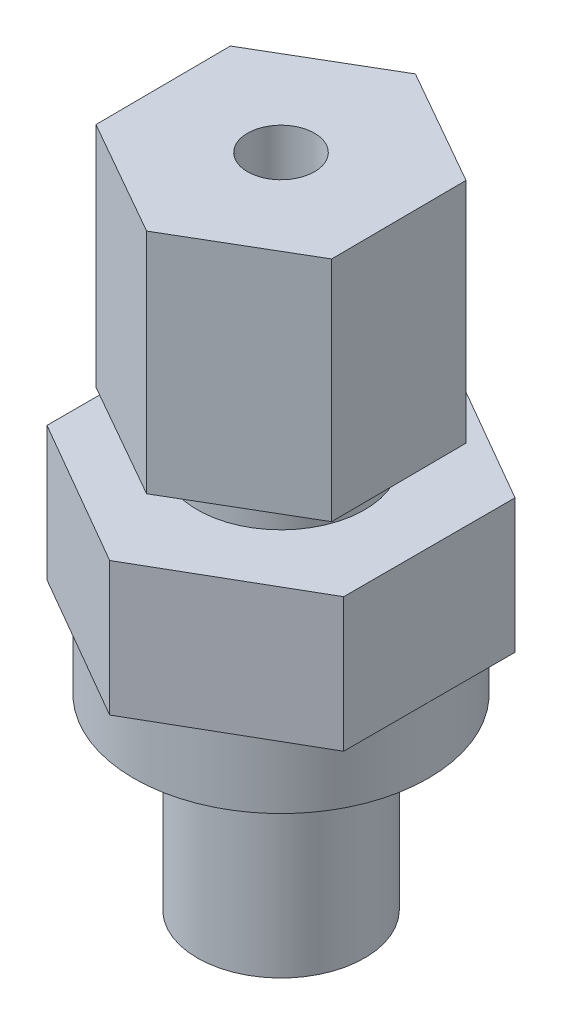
ISO-10303-21;
HEADER;
FILE_DESCRIPTION(('STEP AP214'),'2;1');
FILE_NAME('part.step','',(''),(''),'','','');
FILE_SCHEMA(('AUTOMOTIVE_DESIGN { 1 0 10303 214 1 1 1 1 }'));
ENDSEC;
DATA;
#1=APPLICATION_CONTEXT('core data for automotive mechanical design processes');
#2=APPLICATION_PROTOCOL_DEFINITION('international standard','automotive_design',2000,#1);
#3=PRODUCT_CONTEXT('',#1,'mechanical');
#4=PRODUCT('Part','Part','',(#3));
#5=PRODUCT_RELATED_PRODUCT_CATEGORY('part','',(#4));
#6=PRODUCT_DEFINITION_FORMATION('','',#4);
#7=PRODUCT_DEFINITION_CONTEXT('part definition',#1,'design');
#8=PRODUCT_DEFINITION('design','',#6,#7);
#9=PRODUCT_DEFINITION_SHAPE('','',#8);
#10=(LENGTH_UNIT() NAMED_UNIT(*) SI_UNIT(.MILLI.,.METRE.));
#11=(NAMED_UNIT(*) PLANE_ANGLE_UNIT() SI_UNIT($,.RADIAN.));
#12=(NAMED_UNIT(*) SI_UNIT($,.STERADIAN.) SOLID_ANGLE_UNIT());
#13=UNCERTAINTY_MEASURE_WITH_UNIT(LENGTH_MEASURE(1.E-05),#10,'distance_accuracy_value','');
#14=(GEOMETRIC_REPRESENTATION_CONTEXT(3) GLOBAL_UNCERTAINTY_ASSIGNED_CONTEXT((#13)) GLOBAL_UNIT_ASSIGNED_CONTEXT((#10,
#11,#12)) REPRESENTATION_CONTEXT('',''));
#15=CARTESIAN_POINT('',(0.,0.,0.));
#16=DIRECTION('',(0.,0.,1.));
#17=DIRECTION('',(1.,0.,0.));
#18=AXIS2_PLACEMENT_3D('',#15,#16,#17);
#19=CARTESIAN_POINT('',(-7.03905448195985,18.415,12.192));
#20=DIRECTION('',(0.,-1.,0.));
#21=DIRECTION('',(0.,0.,-1.));
#22=AXIS2_PLACEMENT_3D('',#19,#20,#21);
#23=PLANE('',#22);
#24=DIRECTION('',(0.,0.,1.));
#25=VECTOR('',#24,1.);
#26=CARTESIAN_POINT('',(-7.0390544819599,18.415,-4.06400000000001));
#27=LINE('',#26,#25);
#28=CARTESIAN_POINT('',(-7.0390544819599,18.415,-4.06400000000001));
#29=VERTEX_POINT('',#28);
#30=CARTESIAN_POINT('',(-7.03905448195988,18.415,4.06400000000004));
#31=VERTEX_POINT('',#30);
#32=EDGE_CURVE('E132',#29,#31,#27,.T.);
#33=ORIENTED_EDGE('',*,*,#32,.T.);
#34=DIRECTION('',(0.866025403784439,0.,0.499999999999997));
#35=VECTOR('',#34,1.);
#36=CARTESIAN_POINT('',(-7.03905448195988,18.415,4.06400000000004));
#37=LINE('',#36,#35);
#38=CARTESIAN_POINT('',(0.,18.415,8.128));
#39=VERTEX_POINT('',#38);
#40=EDGE_CURVE('E88',#31,#39,#37,.T.);
#41=ORIENTED_EDGE('',*,*,#40,.T.);
#42=DIRECTION('',(0.86602540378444,0.,-0.499999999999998));
#43=VECTOR('',#42,1.);
#44=CARTESIAN_POINT('',(7.03905448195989,18.415,4.06400000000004));
#45=LINE('',#44,#43);
#46=CARTESIAN_POINT('',(7.03905448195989,18.415,4.06400000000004));
#47=VERTEX_POINT('',#46);
#48=EDGE_CURVE('E103',#39,#47,#45,.T.);
#49=ORIENTED_EDGE('',*,*,#48,.T.);
#50=DIRECTION('',(0.,0.,-1.));
#51=VECTOR('',#50,1.);
#52=CARTESIAN_POINT('',(7.03905448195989,18.415,-4.06399999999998));
#53=LINE('',#52,#51);
#54=CARTESIAN_POINT('',(7.03905448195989,18.415,-4.06399999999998));
#55=VERTEX_POINT('',#54);
#56=EDGE_CURVE('E97',#47,#55,#53,.T.);
#57=ORIENTED_EDGE('',*,*,#56,.T.);
#58=DIRECTION('',(-0.866025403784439,0.,-0.499999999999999));
#59=VECTOR('',#58,1.);
#60=CARTESIAN_POINT('',(7.03905448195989,18.415,-4.06399999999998));
#61=LINE('',#60,#59);
#62=CARTESIAN_POINT('',(0.,18.415,-8.12799999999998));
#63=VERTEX_POINT('',#62);
#64=EDGE_CURVE('E101',#55,#63,#61,.T.);
#65=ORIENTED_EDGE('',*,*,#64,.T.);
#66=DIRECTION('',(-0.866025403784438,0.,0.499999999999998));
#67=VECTOR('',#66,1.);
#68=CARTESIAN_POINT('',(-7.0390544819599,18.415,-4.06400000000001));
#69=LINE('',#68,#67);
#70=EDGE_CURVE('E49',#63,#29,#69,.T.);
#71=ORIENTED_EDGE('',*,*,#70,.T.);
#72=EDGE_LOOP('',(#33,#41,#49,#57,#65,#71));
#73=FACE_BOUND('',#72,.T.);
#74=CARTESIAN_POINT('',(0.,18.415,0.));
#75=DIRECTION('',(0.,-1.,0.));
#76=DIRECTION('',(0.,0.,-1.));
#77=AXIS2_PLACEMENT_3D('',#74,#75,#76);
#78=CIRCLE('',#77,3.96875);
#79=CARTESIAN_POINT('',(0.,18.415,-3.96875));
#80=VERTEX_POINT('',#79);
#81=EDGE_CURVE('E11',#80,#80,#78,.F.);
#82=ORIENTED_EDGE('',*,*,#81,.F.);
#83=EDGE_LOOP('',(#82));
#84=FACE_BOUND('',#83,.T.);
#85=ADVANCED_FACE('F30',(#73,#84),#23,.F.);
#86=CARTESIAN_POINT('',(0.,8.88999999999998,0.));
#87=DIRECTION('',(0.,-1.,0.));
#88=DIRECTION('',(0.,0.,-1.));
#89=AXIS2_PLACEMENT_3D('',#86,#87,#88);
#90=CYLINDRICAL_SURFACE('',#89,3.96875);
#91=CARTESIAN_POINT('',(0.,8.88999999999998,0.));
#92=DIRECTION('',(0.,1.,0.));
#93=DIRECTION('',(0.,0.,1.));
#94=AXIS2_PLACEMENT_3D('',#91,#92,#93);
#95=CIRCLE('',#94,3.96875);
#96=CARTESIAN_POINT('',(0.,8.88999999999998,3.96875));
#97=VERTEX_POINT('',#96);
#98=EDGE_CURVE('E40',#97,#97,#95,.T.);
#99=ORIENTED_EDGE('',*,*,#98,.F.);
#100=EDGE_LOOP('',(#99));
#101=FACE_BOUND('',#100,.T.);
#102=CARTESIAN_POINT('',(0.,0.,0.));
#103=DIRECTION('',(0.,1.,0.));
#104=DIRECTION('',(0.,0.,1.));
#105=AXIS2_PLACEMENT_3D('',#102,#103,#104);
#106=CIRCLE('',#105,3.96875);
#107=CARTESIAN_POINT('',(0.,0.,3.96875));
#108=VERTEX_POINT('',#107);
#109=EDGE_CURVE('E145',#108,#108,#106,.T.);
#110=ORIENTED_EDGE('',*,*,#109,.T.);
#111=EDGE_LOOP('',(#110));
#112=FACE_BOUND('',#111,.T.);
#113=ADVANCED_FACE('F32',(#101,#112),#90,.T.);
#114=CARTESIAN_POINT('',(0.,0.,0.));
#115=DIRECTION('',(0.,1.,0.));
#116=DIRECTION('',(0.,0.,1.));
#117=AXIS2_PLACEMENT_3D('',#114,#115,#116);
#118=PLANE('',#117);
#119=CARTESIAN_POINT('',(0.,0.,0.));
#120=DIRECTION('',(0.,-1.,0.));
#121=DIRECTION('',(0.,0.,-1.));
#122=AXIS2_PLACEMENT_3D('',#119,#120,#121);
#123=CIRCLE('',#122,1.1684);
#124=CARTESIAN_POINT('',(0.,0.,-1.1684));
#125=VERTEX_POINT('',#124);
#126=EDGE_CURVE('E239',#125,#125,#123,.T.);
#127=ORIENTED_EDGE('',*,*,#126,.F.);
#128=EDGE_LOOP('',(#127));
#129=FACE_BOUND('',#128,.T.);
#130=ORIENTED_EDGE('',*,*,#109,.F.);
#131=EDGE_LOOP('',(#130));
#132=FACE_BOUND('',#131,.T.);
#133=ADVANCED_FACE('F212',(#129,#132),#118,.F.);
#134=CARTESIAN_POINT('',(0.,8.88999999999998,0.));
#135=DIRECTION('',(0.,1.,0.));
#136=DIRECTION('',(0.,0.,1.));
#137=AXIS2_PLACEMENT_3D('',#134,#135,#136);
#138=PLANE('',#137);
#139=CARTESIAN_POINT('',(0.,8.88999999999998,0.));
#140=DIRECTION('',(0.,1.,0.));
#141=DIRECTION('',(0.,0.,1.));
#142=AXIS2_PLACEMENT_3D('',#139,#140,#141);
#143=CIRCLE('',#142,6.985);
#144=CARTESIAN_POINT('',(0.,8.88999999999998,6.985));
#145=VERTEX_POINT('',#144);
#146=EDGE_CURVE('E141',#145,#145,#143,.T.);
#147=ORIENTED_EDGE('',*,*,#146,.F.);
#148=EDGE_LOOP('',(#147));
#149=FACE_BOUND('',#148,.T.);
#150=ORIENTED_EDGE('',*,*,#98,.T.);
#151=EDGE_LOOP('',(#150));
#152=FACE_BOUND('',#151,.T.);
#153=ADVANCED_FACE('F222',(#149,#152),#138,.F.);
#154=CARTESIAN_POINT('',(0.,12.065,0.));
#155=DIRECTION('',(0.,-1.,0.));
#156=DIRECTION('',(0.,0.,-1.));
#157=AXIS2_PLACEMENT_3D('',#154,#155,#156);
#158=CYLINDRICAL_SURFACE('',#157,6.985);
#159=CARTESIAN_POINT('',(0.,12.065,0.));
#160=DIRECTION('',(0.,1.,0.));
#161=DIRECTION('',(0.,0.,1.));
#162=AXIS2_PLACEMENT_3D('',#159,#160,#161);
#163=CIRCLE('',#162,6.985);
#164=CARTESIAN_POINT('',(0.,12.065,6.985));
#165=VERTEX_POINT('',#164);
#166=EDGE_CURVE('E142',#165,#165,#163,.T.);
#167=ORIENTED_EDGE('',*,*,#166,.F.);
#168=EDGE_LOOP('',(#167));
#169=FACE_BOUND('',#168,.T.);
#170=ORIENTED_EDGE('',*,*,#146,.T.);
#171=EDGE_LOOP('',(#170));
#172=FACE_BOUND('',#171,.T.);
#173=ADVANCED_FACE('F216',(#169,#172),#158,.T.);
#174=CARTESIAN_POINT('',(-7.03905448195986,12.065,12.192));
#175=DIRECTION('',(0.,-1.,0.));
#176=DIRECTION('',(0.,0.,-1.));
#177=AXIS2_PLACEMENT_3D('',#174,#175,#176);
#178=PLANE('',#177);
#179=DIRECTION('',(0.,0.,1.));
#180=VECTOR('',#179,1.);
#181=CARTESIAN_POINT('',(-7.0390544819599,12.065,-4.06400000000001));
#182=LINE('',#181,#180);
#183=CARTESIAN_POINT('',(-7.0390544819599,12.065,-4.06400000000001));
#184=VERTEX_POINT('',#183);
#185=CARTESIAN_POINT('',(-7.03905448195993,12.065,4.06400000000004));
#186=VERTEX_POINT('',#185);
#187=EDGE_CURVE('E121',#184,#186,#182,.T.);
#188=ORIENTED_EDGE('',*,*,#187,.F.);
#189=DIRECTION('',(-0.866025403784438,0.,0.499999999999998));
#190=VECTOR('',#189,1.);
#191=CARTESIAN_POINT('',(-7.0390544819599,12.065,-4.06400000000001));
#192=LINE('',#191,#190);
#193=CARTESIAN_POINT('',(0.,12.065,-8.12799999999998));
#194=VERTEX_POINT('',#193);
#195=EDGE_CURVE('E79',#194,#184,#192,.T.);
#196=ORIENTED_EDGE('',*,*,#195,.F.);
#197=DIRECTION('',(-0.866025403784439,0.,-0.499999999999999));
#198=VECTOR('',#197,1.);
#199=CARTESIAN_POINT('',(7.03905448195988,12.065,-4.06399999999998));
#200=LINE('',#199,#198);
#201=CARTESIAN_POINT('',(7.03905448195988,12.065,-4.06399999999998));
#202=VERTEX_POINT('',#201);
#203=EDGE_CURVE('E73',#202,#194,#200,.T.);
#204=ORIENTED_EDGE('',*,*,#203,.F.);
#205=DIRECTION('',(0.,0.,-1.));
#206=VECTOR('',#205,1.);
#207=CARTESIAN_POINT('',(7.03905448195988,12.065,-4.06399999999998));
#208=LINE('',#207,#206);
#209=CARTESIAN_POINT('',(7.03905448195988,12.065,4.06400000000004));
#210=VERTEX_POINT('',#209);
#211=EDGE_CURVE('E111',#210,#202,#208,.T.);
#212=ORIENTED_EDGE('',*,*,#211,.F.);
#213=DIRECTION('',(0.86602540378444,0.,-0.499999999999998));
#214=VECTOR('',#213,1.);
#215=CARTESIAN_POINT('',(7.03905448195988,12.065,4.06400000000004));
#216=LINE('',#215,#214);
#217=CARTESIAN_POINT('',(0.,12.065,8.128));
#218=VERTEX_POINT('',#217);
#219=EDGE_CURVE('E127',#218,#210,#216,.T.);
#220=ORIENTED_EDGE('',*,*,#219,.F.);
#221=DIRECTION('',(0.866025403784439,0.,0.499999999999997));
#222=VECTOR('',#221,1.);
#223=CARTESIAN_POINT('',(-7.03905448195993,12.065,4.06400000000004));
#224=LINE('',#223,#222);
#225=EDGE_CURVE('E124',#186,#218,#224,.T.);
#226=ORIENTED_EDGE('',*,*,#225,.F.);
#227=EDGE_LOOP('',(#188,#196,#204,#212,#220,#226));
#228=FACE_BOUND('',#227,.T.);
#229=ORIENTED_EDGE('',*,*,#166,.T.);
#230=EDGE_LOOP('',(#229));
#231=FACE_BOUND('',#230,.T.);
#232=ADVANCED_FACE('F191',(#228,#231),#178,.T.);
#233=CARTESIAN_POINT('',(-7.0390544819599,18.415,-4.06400000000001));
#234=DIRECTION('',(1.,0.,0.));
#235=DIRECTION('',(0.,0.,-1.));
#236=AXIS2_PLACEMENT_3D('',#233,#234,#235);
#237=PLANE('',#236);
#238=ORIENTED_EDGE('',*,*,#187,.T.);
#239=DIRECTION('',(0.,-1.,0.));
#240=VECTOR('',#239,1.);
#241=CARTESIAN_POINT('',(-7.03905448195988,18.415,4.06400000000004));
#242=LINE('',#241,#240);
#243=EDGE_CURVE('E139',#31,#186,#242,.T.);
#244=ORIENTED_EDGE('',*,*,#243,.F.);
#245=ORIENTED_EDGE('',*,*,#32,.F.);
#246=DIRECTION('',(0.,-1.,0.));
#247=VECTOR('',#246,1.);
#248=CARTESIAN_POINT('',(-7.0390544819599,18.415,-4.06400000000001));
#249=LINE('',#248,#247);
#250=EDGE_CURVE('E117',#29,#184,#249,.T.);
#251=ORIENTED_EDGE('',*,*,#250,.T.);
#252=EDGE_LOOP('',(#238,#244,#245,#251));
#253=FACE_BOUND('',#252,.T.);
#254=ADVANCED_FACE('F194',(#253),#237,.F.);
#255=CARTESIAN_POINT('',(-7.03905448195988,18.415,4.06400000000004));
#256=DIRECTION('',(0.499999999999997,0.,-0.866025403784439));
#257=DIRECTION('',(-0.866025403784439,0.,-0.499999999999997));
#258=AXIS2_PLACEMENT_3D('',#255,#256,#257);
#259=PLANE('',#258);
#260=ORIENTED_EDGE('',*,*,#225,.T.);
#261=DIRECTION('',(0.,-1.,0.));
#262=VECTOR('',#261,1.);
#263=CARTESIAN_POINT('',(0.,18.415,8.128));
#264=LINE('',#263,#262);
#265=EDGE_CURVE('E136',#39,#218,#264,.T.);
#266=ORIENTED_EDGE('',*,*,#265,.F.);
#267=ORIENTED_EDGE('',*,*,#40,.F.);
#268=ORIENTED_EDGE('',*,*,#243,.T.);
#269=EDGE_LOOP('',(#260,#266,#267,#268));
#270=FACE_BOUND('',#269,.T.);
#271=ADVANCED_FACE('F185',(#270),#259,.F.);
#272=CARTESIAN_POINT('',(7.03905448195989,18.415,4.06400000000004));
#273=DIRECTION('',(-0.499999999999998,0.,-0.866025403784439));
#274=DIRECTION('',(-0.866025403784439,0.,0.499999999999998));
#275=AXIS2_PLACEMENT_3D('',#272,#273,#274);
#276=PLANE('',#275);
#277=ORIENTED_EDGE('',*,*,#219,.T.);
#278=DIRECTION('',(0.,-1.,0.));
#279=VECTOR('',#278,1.);
#280=CARTESIAN_POINT('',(7.03905448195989,18.415,4.06400000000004));
#281=LINE('',#280,#279);
#282=EDGE_CURVE('E112',#47,#210,#281,.T.);
#283=ORIENTED_EDGE('',*,*,#282,.F.);
#284=ORIENTED_EDGE('',*,*,#48,.F.);
#285=ORIENTED_EDGE('',*,*,#265,.T.);
#286=EDGE_LOOP('',(#277,#283,#284,#285));
#287=FACE_BOUND('',#286,.T.);
#288=ADVANCED_FACE('F188',(#287),#276,.F.);
#289=CARTESIAN_POINT('',(7.03905448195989,18.415,-4.06399999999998));
#290=DIRECTION('',(-1.,0.,0.));
#291=DIRECTION('',(0.,0.,1.));
#292=AXIS2_PLACEMENT_3D('',#289,#290,#291);
#293=PLANE('',#292);
#294=ORIENTED_EDGE('',*,*,#211,.T.);
#295=DIRECTION('',(0.,-1.,0.));
#296=VECTOR('',#295,1.);
#297=CARTESIAN_POINT('',(7.03905448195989,18.415,-4.06399999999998));
#298=LINE('',#297,#296);
#299=EDGE_CURVE('E108',#55,#202,#298,.T.);
#300=ORIENTED_EDGE('',*,*,#299,.F.);
#301=ORIENTED_EDGE('',*,*,#56,.F.);
#302=ORIENTED_EDGE('',*,*,#282,.T.);
#303=EDGE_LOOP('',(#294,#300,#301,#302));
#304=FACE_BOUND('',#303,.T.);
#305=ADVANCED_FACE('F109',(#304),#293,.F.);
#306=CARTESIAN_POINT('',(7.03905448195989,18.415,-4.06399999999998));
#307=DIRECTION('',(-0.499999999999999,0.,0.866025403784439));
#308=DIRECTION('',(0.866025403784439,0.,0.499999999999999));
#309=AXIS2_PLACEMENT_3D('',#306,#307,#308);
#310=PLANE('',#309);
#311=ORIENTED_EDGE('',*,*,#203,.T.);
#312=DIRECTION('',(0.,-1.,0.));
#313=VECTOR('',#312,1.);
#314=CARTESIAN_POINT('',(0.,18.415,-8.12799999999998));
#315=LINE('',#314,#313);
#316=EDGE_CURVE('E113',#63,#194,#315,.T.);
#317=ORIENTED_EDGE('',*,*,#316,.F.);
#318=ORIENTED_EDGE('',*,*,#64,.F.);
#319=ORIENTED_EDGE('',*,*,#299,.T.);
#320=EDGE_LOOP('',(#311,#317,#318,#319));
#321=FACE_BOUND('',#320,.T.);
#322=ADVANCED_FACE('F115',(#321),#310,.F.);
#323=CARTESIAN_POINT('',(-7.0390544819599,18.415,-4.06400000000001));
#324=DIRECTION('',(0.499999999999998,0.,0.866025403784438));
#325=DIRECTION('',(0.866025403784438,0.,-0.499999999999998));
#326=AXIS2_PLACEMENT_3D('',#323,#324,#325);
#327=PLANE('',#326);
#328=ORIENTED_EDGE('',*,*,#195,.T.);
#329=ORIENTED_EDGE('',*,*,#250,.F.);
#330=ORIENTED_EDGE('',*,*,#70,.F.);
#331=ORIENTED_EDGE('',*,*,#316,.T.);
#332=EDGE_LOOP('',(#328,#329,#330,#331));
#333=FACE_BOUND('',#332,.T.);
#334=ADVANCED_FACE('F195',(#333),#327,.F.);
#335=CARTESIAN_POINT('',(0.,27.94,0.));
#336=DIRECTION('',(0.,-1.,0.));
#337=DIRECTION('',(0.,0.,-1.));
#338=AXIS2_PLACEMENT_3D('',#335,#336,#337);
#339=CYLINDRICAL_SURFACE('',#338,3.96875);
#340=CARTESIAN_POINT('',(0.,20.32,0.));
#341=DIRECTION('',(0.,-1.,0.));
#342=DIRECTION('',(0.,0.,-1.));
#343=AXIS2_PLACEMENT_3D('',#340,#341,#342);
#344=CIRCLE('',#343,3.96875);
#345=CARTESIAN_POINT('',(0.,20.32,-3.96875));
#346=VERTEX_POINT('',#345);
#347=EDGE_CURVE('E125',#346,#346,#344,.T.);
#348=CARTESIAN_POINT('',(0.,20.32,-3.96875));
#349=CARTESIAN_POINT('',(0.,20.30015625,-3.96875));
#350=CARTESIAN_POINT('',(0.,20.2803125,-3.96875));
#351=CARTESIAN_POINT('',(0.,20.240625,-3.96875));
#352=CARTESIAN_POINT('',(0.,20.22078125,-3.96875));
#353=CARTESIAN_POINT('',(0.,20.18109375,-3.96875));
#354=CARTESIAN_POINT('',(0.,20.16125,-3.96875));
#355=CARTESIAN_POINT('',(0.,20.1215625,-3.96875));
#356=CARTESIAN_POINT('',(0.,20.10171875,-3.96875));
#357=CARTESIAN_POINT('',(0.,20.06203125,-3.96875));
#358=CARTESIAN_POINT('',(0.,20.0421875,-3.96875));
#359=CARTESIAN_POINT('',(0.,20.0025,-3.96875));
#360=CARTESIAN_POINT('',(0.,19.98265625,-3.96875));
#361=CARTESIAN_POINT('',(0.,19.94296875,-3.96875));
#362=CARTESIAN_POINT('',(0.,19.923125,-3.96875));
#363=CARTESIAN_POINT('',(0.,19.8834375,-3.96875));
#364=CARTESIAN_POINT('',(0.,19.86359375,-3.96875));
#365=CARTESIAN_POINT('',(0.,19.82390625,-3.96875));
#366=CARTESIAN_POINT('',(0.,19.8040625,-3.96875));
#367=CARTESIAN_POINT('',(0.,19.764375,-3.96875));
#368=CARTESIAN_POINT('',(0.,19.74453125,-3.96875));
#369=CARTESIAN_POINT('',(0.,19.70484375,-3.96875));
#370=CARTESIAN_POINT('',(0.,19.685,-3.96875));
#371=CARTESIAN_POINT('',(0.,19.6453125,-3.96875));
#372=CARTESIAN_POINT('',(0.,19.62546875,-3.96875));
#373=CARTESIAN_POINT('',(0.,19.58578125,-3.96875));
#374=CARTESIAN_POINT('',(0.,19.5659375,-3.96875));
#375=CARTESIAN_POINT('',(0.,19.52625,-3.96875));
#376=CARTESIAN_POINT('',(0.,19.50640625,-3.96875));
#377=CARTESIAN_POINT('',(0.,19.46671875,-3.96875));
#378=CARTESIAN_POINT('',(0.,19.446875,-3.96875));
#379=CARTESIAN_POINT('',(0.,19.4071875,-3.96875));
#380=CARTESIAN_POINT('',(0.,19.38734375,-3.96875));
#381=CARTESIAN_POINT('',(0.,19.34765625,-3.96875));
#382=CARTESIAN_POINT('',(0.,19.3278125,-3.96875));
#383=CARTESIAN_POINT('',(0.,19.288125,-3.96875));
#384=CARTESIAN_POINT('',(0.,19.26828125,-3.96875));
#385=CARTESIAN_POINT('',(0.,19.22859375,-3.96875));
#386=CARTESIAN_POINT('',(0.,19.20875,-3.96875));
#387=CARTESIAN_POINT('',(0.,19.1690625,-3.96875));
#388=CARTESIAN_POINT('',(0.,19.14921875,-3.96875));
#389=CARTESIAN_POINT('',(0.,19.10953125,-3.96875));
#390=CARTESIAN_POINT('',(0.,19.0896875,-3.96875));
#391=CARTESIAN_POINT('',(0.,19.05,-3.96875));
#392=CARTESIAN_POINT('',(0.,19.03015625,-3.96875));
#393=CARTESIAN_POINT('',(0.,18.99046875,-3.96875));
#394=CARTESIAN_POINT('',(0.,18.970625,-3.96875));
#395=CARTESIAN_POINT('',(0.,18.9309375,-3.96875));
#396=CARTESIAN_POINT('',(0.,18.91109375,-3.96875));
#397=CARTESIAN_POINT('',(0.,18.87140625,-3.96875));
#398=CARTESIAN_POINT('',(0.,18.8515625,-3.96875));
#399=CARTESIAN_POINT('',(0.,18.811875,-3.96875));
#400=CARTESIAN_POINT('',(0.,18.79203125,-3.96875));
#401=CARTESIAN_POINT('',(0.,18.75234375,-3.96875));
#402=CARTESIAN_POINT('',(0.,18.7325,-3.96875));
#403=CARTESIAN_POINT('',(0.,18.6928125,-3.96875));
#404=CARTESIAN_POINT('',(0.,18.67296875,-3.96875));
#405=CARTESIAN_POINT('',(0.,18.63328125,-3.96875));
#406=CARTESIAN_POINT('',(0.,18.6134375,-3.96875));
#407=CARTESIAN_POINT('',(0.,18.57375,-3.96875));
#408=CARTESIAN_POINT('',(0.,18.55390625,-3.96875));
#409=CARTESIAN_POINT('',(0.,18.51421875,-3.96875));
#410=CARTESIAN_POINT('',(0.,18.494375,-3.96875));
#411=CARTESIAN_POINT('',(0.,18.4546875,-3.96875));
#412=CARTESIAN_POINT('',(0.,18.43484375,-3.96875));
#413=CARTESIAN_POINT('',(0.,18.415,-3.96875));
#414=B_SPLINE_CURVE_WITH_KNOTS('',3,(#348,#349,#350,#351,#352,#353,#354,#355,#356,#357,#358,
#359,#360,#361,#362,#363,#364,#365,#366,#367,#368,#369,#370,#371,#372,#373,#374,#375,#376,#377,
#378,#379,#380,#381,#382,#383,#384,#385,#386,#387,#388,#389,#390,#391,#392,#393,#394,#395,#396,
#397,#398,#399,#400,#401,#402,#403,#404,#405,#406,#407,#408,#409,#410,#411,#412,#413),
.UNSPECIFIED.,.F.,.F.,(4,2,2,2,2,2,2,2,2,2,2,2,2,2,2,2,2,2,2,2,2,2,2,2,2,2,2,2,2,2,2,2,4),(0.,
0.0595312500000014,0.119062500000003,0.178593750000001,0.238125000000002,0.297656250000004,
0.357187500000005,0.416718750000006,0.476250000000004,0.535781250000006,0.595312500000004,
0.654843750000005,0.714375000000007,0.773906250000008,0.833437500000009,0.892968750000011,
0.952500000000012,1.01203125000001,1.07156250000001,1.13109375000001,1.19062500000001,
1.25015625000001,1.30968750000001,1.36921875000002,1.42875000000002,1.48828125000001,
1.54781250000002,1.60734375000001,1.66687500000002,1.72640625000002,1.78593750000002,
1.84546875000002,1.90500000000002),.UNSPECIFIED.);
#415=EDGE_CURVE('BSEAM197',#346,#80,#414,.T.);
#416=ORIENTED_EDGE('',*,*,#347,.T.);
#417=ORIENTED_EDGE('',*,*,#81,.T.);
#418=ORIENTED_EDGE('',*,*,#415,.T.);
#419=ORIENTED_EDGE('',*,*,#415,.F.);
#420=EDGE_LOOP('',(#416,#418,#417,#419));
#421=FACE_BOUND('',#420,.T.);
#422=ADVANCED_FACE('F197',(#421),#339,.T.);
#423=CARTESIAN_POINT('',(0.0404374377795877,20.32,6.41567743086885));
#424=DIRECTION('',(0.,-1.,0.));
#425=DIRECTION('',(0.,0.,-1.));
#426=AXIS2_PLACEMENT_3D('',#423,#424,#425);
#427=PLANE('',#426);
#428=DIRECTION('',(0.862856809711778,0.,-0.505448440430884));
#429=VECTOR('',#428,1.);
#430=CARTESIAN_POINT('',(0.0404374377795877,20.32,6.41567743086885));
#431=LINE('',#430,#429);
#432=CARTESIAN_POINT('',(0.0404374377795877,20.32,6.41567743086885));
#433=VERTEX_POINT('',#432);
#434=CARTESIAN_POINT('',(5.5763583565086,20.3200000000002,3.17281886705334));
#435=VERTEX_POINT('',#434);
#436=EDGE_CURVE('E269',#433,#435,#431,.T.);
#437=ORIENTED_EDGE('',*,*,#436,.F.);
#438=DIRECTION('',(0.86915959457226,0.,0.494531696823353));
#439=VECTOR('',#438,1.);
#440=CARTESIAN_POINT('',(-5.5359209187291,20.32,3.24285856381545));
#441=LINE('',#440,#439);
#442=CARTESIAN_POINT('',(-5.5359209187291,20.32,3.24285856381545));
#443=VERTEX_POINT('',#442);
#444=EDGE_CURVE('E168',#443,#433,#441,.T.);
#445=ORIENTED_EDGE('',*,*,#444,.F.);
#446=DIRECTION('',(0.00630278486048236,0.,0.999980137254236));
#447=VECTOR('',#446,1.);
#448=CARTESIAN_POINT('',(-5.57635835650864,20.32,-3.17281886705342));
#449=LINE('',#448,#447);
#450=CARTESIAN_POINT('',(-5.57635835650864,20.32,-3.17281886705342));
#451=VERTEX_POINT('',#450);
#452=EDGE_CURVE('E280',#451,#443,#449,.T.);
#453=ORIENTED_EDGE('',*,*,#452,.F.);
#454=DIRECTION('',(-0.862856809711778,0.,0.505448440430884));
#455=VECTOR('',#454,1.);
#456=CARTESIAN_POINT('',(-0.040437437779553,20.3200000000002,-6.41567743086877));
#457=LINE('',#456,#455);
#458=CARTESIAN_POINT('',(-0.040437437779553,20.3200000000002,-6.41567743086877));
#459=VERTEX_POINT('',#458);
#460=EDGE_CURVE('E278',#459,#451,#457,.T.);
#461=ORIENTED_EDGE('',*,*,#460,.F.);
#462=DIRECTION('',(-0.869159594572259,0.,-0.494531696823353));
#463=VECTOR('',#462,1.);
#464=CARTESIAN_POINT('',(5.53592091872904,20.32,-3.24285856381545));
#465=LINE('',#464,#463);
#466=CARTESIAN_POINT('',(5.53592091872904,20.32,-3.24285856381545));
#467=VERTEX_POINT('',#466);
#468=EDGE_CURVE('E275',#467,#459,#465,.T.);
#469=ORIENTED_EDGE('',*,*,#468,.F.);
#470=DIRECTION('',(-0.00630278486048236,0.,-0.999980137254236));
#471=VECTOR('',#470,1.);
#472=CARTESIAN_POINT('',(5.5763583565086,20.3200000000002,3.17281886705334));
#473=LINE('',#472,#471);
#474=EDGE_CURVE('E272',#435,#467,#473,.T.);
#475=ORIENTED_EDGE('',*,*,#474,.F.);
#476=EDGE_LOOP('',(#437,#445,#453,#461,#469,#475));
#477=FACE_BOUND('',#476,.T.);
#478=ORIENTED_EDGE('',*,*,#347,.F.);
#479=EDGE_LOOP('',(#478));
#480=FACE_BOUND('',#479,.T.);
#481=ADVANCED_FACE('F203',(#477,#480),#427,.T.);
#482=CARTESIAN_POINT('',(0.0404374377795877,20.32,6.41567743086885));
#483=DIRECTION('',(0.505448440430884,0.,0.862856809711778));
#484=DIRECTION('',(0.862856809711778,0.,-0.505448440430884));
#485=AXIS2_PLACEMENT_3D('',#482,#483,#484);
#486=PLANE('',#485);
#487=DIRECTION('',(0.,1.,0.));
#488=VECTOR('',#487,1.);
#489=CARTESIAN_POINT('',(5.5763583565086,20.3200000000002,3.17281886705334));
#490=LINE('',#489,#488);
#491=CARTESIAN_POINT('',(5.57635835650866,31.1150000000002,3.17281886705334));
#492=VERTEX_POINT('',#491);
#493=EDGE_CURVE('E179',#435,#492,#490,.T.);
#494=ORIENTED_EDGE('',*,*,#493,.T.);
#495=DIRECTION('',(0.862856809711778,0.,-0.505448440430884));
#496=VECTOR('',#495,1.);
#497=CARTESIAN_POINT('',(0.0404374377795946,31.115,6.41567743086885));
#498=LINE('',#497,#496);
#499=CARTESIAN_POINT('',(0.0404374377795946,31.115,6.41567743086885));
#500=VERTEX_POINT('',#499);
#501=EDGE_CURVE('E250',#500,#492,#498,.T.);
#502=ORIENTED_EDGE('',*,*,#501,.F.);
#503=DIRECTION('',(0.,1.,0.));
#504=VECTOR('',#503,1.);
#505=CARTESIAN_POINT('',(0.0404374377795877,20.32,6.41567743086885));
#506=LINE('',#505,#504);
#507=EDGE_CURVE('E152',#433,#500,#506,.T.);
#508=ORIENTED_EDGE('',*,*,#507,.F.);
#509=ORIENTED_EDGE('',*,*,#436,.T.);
#510=EDGE_LOOP('',(#494,#502,#508,#509));
#511=FACE_BOUND('',#510,.T.);
#512=ADVANCED_FACE('F319',(#511),#486,.T.);
#513=CARTESIAN_POINT('',(-5.5359209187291,20.32,3.24285856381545));
#514=DIRECTION('',(-0.494531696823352,0.,0.869159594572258));
#515=DIRECTION('',(0.869159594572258,0.,0.494531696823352));
#516=AXIS2_PLACEMENT_3D('',#513,#514,#515);
#517=PLANE('',#516);
#518=ORIENTED_EDGE('',*,*,#507,.T.);
#519=DIRECTION('',(0.86915959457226,0.,0.494531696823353));
#520=VECTOR('',#519,1.);
#521=CARTESIAN_POINT('',(-5.53592091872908,31.115,3.24285856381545));
#522=LINE('',#521,#520);
#523=CARTESIAN_POINT('',(-5.53592091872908,31.115,3.24285856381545));
#524=VERTEX_POINT('',#523);
#525=EDGE_CURVE('E267',#524,#500,#522,.T.);
#526=ORIENTED_EDGE('',*,*,#525,.F.);
#527=DIRECTION('',(0.,1.,0.));
#528=VECTOR('',#527,1.);
#529=CARTESIAN_POINT('',(-5.5359209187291,20.32,3.24285856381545));
#530=LINE('',#529,#528);
#531=EDGE_CURVE('E156',#443,#524,#530,.T.);
#532=ORIENTED_EDGE('',*,*,#531,.F.);
#533=ORIENTED_EDGE('',*,*,#444,.T.);
#534=EDGE_LOOP('',(#518,#526,#532,#533));
#535=FACE_BOUND('',#534,.T.);
#536=ADVANCED_FACE('F288',(#535),#517,.T.);
#537=CARTESIAN_POINT('',(-5.57635835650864,20.32,-3.17281886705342));
#538=DIRECTION('',(-0.999980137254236,0.,0.00630278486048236));
#539=DIRECTION('',(0.00630278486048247,0.,0.999980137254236));
#540=AXIS2_PLACEMENT_3D('',#537,#538,#539);
#541=PLANE('',#540);
#542=ORIENTED_EDGE('',*,*,#531,.T.);
#543=DIRECTION('',(0.00630278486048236,0.,0.999980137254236));
#544=VECTOR('',#543,1.);
#545=CARTESIAN_POINT('',(-5.57635835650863,31.115,-3.17281886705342));
#546=LINE('',#545,#544);
#547=CARTESIAN_POINT('',(-5.57635835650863,31.115,-3.17281886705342));
#548=VERTEX_POINT('',#547);
#549=EDGE_CURVE('E264',#548,#524,#546,.T.);
#550=ORIENTED_EDGE('',*,*,#549,.F.);
#551=DIRECTION('',(0.,1.,0.));
#552=VECTOR('',#551,1.);
#553=CARTESIAN_POINT('',(-5.57635835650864,20.32,-3.17281886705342));
#554=LINE('',#553,#552);
#555=EDGE_CURVE('E165',#451,#548,#554,.T.);
#556=ORIENTED_EDGE('',*,*,#555,.F.);
#557=ORIENTED_EDGE('',*,*,#452,.T.);
#558=EDGE_LOOP('',(#542,#550,#556,#557));
#559=FACE_BOUND('',#558,.T.);
#560=ADVANCED_FACE('F327',(#559),#541,.T.);
#561=CARTESIAN_POINT('',(-0.040437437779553,20.3200000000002,-6.41567743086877));
#562=DIRECTION('',(-0.505448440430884,0.,-0.862856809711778));
#563=DIRECTION('',(-0.862856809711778,0.,0.505448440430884));
#564=AXIS2_PLACEMENT_3D('',#561,#562,#563);
#565=PLANE('',#564);
#566=ORIENTED_EDGE('',*,*,#555,.T.);
#567=DIRECTION('',(-0.862856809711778,0.,0.505448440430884));
#568=VECTOR('',#567,1.);
#569=CARTESIAN_POINT('',(-0.040437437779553,31.1150000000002,-6.41567743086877));
#570=LINE('',#569,#568);
#571=CARTESIAN_POINT('',(-0.040437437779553,31.1150000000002,-6.41567743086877));
#572=VERTEX_POINT('',#571);
#573=EDGE_CURVE('E261',#572,#548,#570,.T.);
#574=ORIENTED_EDGE('',*,*,#573,.F.);
#575=DIRECTION('',(0.,1.,0.));
#576=VECTOR('',#575,1.);
#577=CARTESIAN_POINT('',(-0.040437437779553,20.3200000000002,-6.41567743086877));
#578=LINE('',#577,#576);
#579=EDGE_CURVE('E173',#459,#572,#578,.T.);
#580=ORIENTED_EDGE('',*,*,#579,.F.);
#581=ORIENTED_EDGE('',*,*,#460,.T.);
#582=EDGE_LOOP('',(#566,#574,#580,#581));
#583=FACE_BOUND('',#582,.T.);
#584=ADVANCED_FACE('F329',(#583),#565,.T.);
#585=CARTESIAN_POINT('',(5.53592091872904,20.32,-3.24285856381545));
#586=DIRECTION('',(0.494531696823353,0.,-0.869159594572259));
#587=DIRECTION('',(-0.869159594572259,0.,-0.494531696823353));
#588=AXIS2_PLACEMENT_3D('',#585,#586,#587);
#589=PLANE('',#588);
#590=ORIENTED_EDGE('',*,*,#579,.T.);
#591=DIRECTION('',(-0.869159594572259,0.,-0.494531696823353));
#592=VECTOR('',#591,1.);
#593=CARTESIAN_POINT('',(5.53592091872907,31.115,-3.24285856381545));
#594=LINE('',#593,#592);
#595=CARTESIAN_POINT('',(5.53592091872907,31.115,-3.24285856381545));
#596=VERTEX_POINT('',#595);
#597=EDGE_CURVE('E258',#596,#572,#594,.T.);
#598=ORIENTED_EDGE('',*,*,#597,.F.);
#599=DIRECTION('',(0.,1.,0.));
#600=VECTOR('',#599,1.);
#601=CARTESIAN_POINT('',(5.53592091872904,20.32,-3.24285856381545));
#602=LINE('',#601,#600);
#603=EDGE_CURVE('E176',#467,#596,#602,.T.);
#604=ORIENTED_EDGE('',*,*,#603,.F.);
#605=ORIENTED_EDGE('',*,*,#468,.T.);
#606=EDGE_LOOP('',(#590,#598,#604,#605));
#607=FACE_BOUND('',#606,.T.);
#608=ADVANCED_FACE('F332',(#607),#589,.T.);
#609=CARTESIAN_POINT('',(5.5763583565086,20.3200000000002,3.17281886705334));
#610=DIRECTION('',(0.999980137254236,0.,-0.00630278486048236));
#611=DIRECTION('',(-0.00630278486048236,0.,-0.999980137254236));
#612=AXIS2_PLACEMENT_3D('',#609,#610,#611);
#613=PLANE('',#612);
#614=ORIENTED_EDGE('',*,*,#603,.T.);
#615=DIRECTION('',(-0.00630278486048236,0.,-0.999980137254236));
#616=VECTOR('',#615,1.);
#617=CARTESIAN_POINT('',(5.57635835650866,31.1150000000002,3.17281886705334));
#618=LINE('',#617,#616);
#619=EDGE_CURVE('E255',#492,#596,#618,.T.);
#620=ORIENTED_EDGE('',*,*,#619,.F.);
#621=ORIENTED_EDGE('',*,*,#493,.F.);
#622=ORIENTED_EDGE('',*,*,#474,.T.);
#623=EDGE_LOOP('',(#614,#620,#621,#622));
#624=FACE_BOUND('',#623,.T.);
#625=ADVANCED_FACE('F321',(#624),#613,.T.);
#626=CARTESIAN_POINT('',(0.0404374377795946,31.115,6.41567743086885));
#627=DIRECTION('',(0.,-1.,0.));
#628=DIRECTION('',(0.,0.,-1.));
#629=AXIS2_PLACEMENT_3D('',#626,#627,#628);
#630=PLANE('',#629);
#631=CARTESIAN_POINT('',(0.,31.115,0.));
#632=DIRECTION('',(0.,1.,0.));
#633=DIRECTION('',(0.,0.,1.));
#634=AXIS2_PLACEMENT_3D('',#631,#632,#633);
#635=CIRCLE('',#634,1.5875);
#636=CARTESIAN_POINT('',(0.,31.115,1.5875));
#637=VERTEX_POINT('',#636);
#638=EDGE_CURVE('E245',#637,#637,#635,.T.);
#639=ORIENTED_EDGE('',*,*,#638,.F.);
#640=EDGE_LOOP('',(#639));
#641=FACE_BOUND('',#640,.T.);
#642=ORIENTED_EDGE('',*,*,#501,.T.);
#643=ORIENTED_EDGE('',*,*,#619,.T.);
#644=ORIENTED_EDGE('',*,*,#597,.T.);
#645=ORIENTED_EDGE('',*,*,#573,.T.);
#646=ORIENTED_EDGE('',*,*,#549,.T.);
#647=ORIENTED_EDGE('',*,*,#525,.T.);
#648=EDGE_LOOP('',(#642,#643,#644,#645,#646,#647));
#649=FACE_BOUND('',#648,.T.);
#650=ADVANCED_FACE('F324',(#641,#649),#630,.F.);
#651=CARTESIAN_POINT('',(0.,18.415,0.));
#652=DIRECTION('',(0.,1.,0.));
#653=DIRECTION('',(0.,0.,1.));
#654=AXIS2_PLACEMENT_3D('',#651,#652,#653);
#655=CYLINDRICAL_SURFACE('',#654,1.5875);
#656=CARTESIAN_POINT('',(0.,18.415,0.));
#657=DIRECTION('',(0.,1.,0.));
#658=DIRECTION('',(0.,0.,1.));
#659=AXIS2_PLACEMENT_3D('',#656,#657,#658);
#660=CIRCLE('',#659,1.5875);
#661=CARTESIAN_POINT('',(0.,18.415,1.5875));
#662=VERTEX_POINT('',#661);
#663=EDGE_CURVE('E247',#662,#662,#660,.T.);
#664=ORIENTED_EDGE('',*,*,#663,.F.);
#665=EDGE_LOOP('',(#664));
#666=FACE_BOUND('',#665,.T.);
#667=ORIENTED_EDGE('',*,*,#638,.T.);
#668=EDGE_LOOP('',(#667));
#669=FACE_BOUND('',#668,.T.);
#670=ADVANCED_FACE('F375',(#666,#669),#655,.F.);
#671=CARTESIAN_POINT('',(0.,18.415,0.));
#672=DIRECTION('',(0.,1.,0.));
#673=DIRECTION('',(0.,0.,1.));
#674=AXIS2_PLACEMENT_3D('',#671,#672,#673);
#675=PLANE('',#674);
#676=CARTESIAN_POINT('',(0.,18.415,0.));
#677=DIRECTION('',(0.,1.,0.));
#678=DIRECTION('',(0.,0.,1.));
#679=AXIS2_PLACEMENT_3D('',#676,#677,#678);
#680=CIRCLE('',#679,1.1684);
#681=CARTESIAN_POINT('',(0.,18.415,-1.1684));
#682=VERTEX_POINT('',#681);
#683=EDGE_CURVE('E34',#682,#682,#680,.T.);
#684=ORIENTED_EDGE('',*,*,#683,.F.);
#685=EDGE_LOOP('',(#684));
#686=FACE_BOUND('',#685,.T.);
#687=ORIENTED_EDGE('',*,*,#663,.T.);
#688=EDGE_LOOP('',(#687));
#689=FACE_BOUND('',#688,.T.);
#690=ADVANCED_FACE('F382',(#686,#689),#675,.T.);
#691=CARTESIAN_POINT('',(0.,31.115,0.));
#692=DIRECTION('',(0.,-1.,0.));
#693=DIRECTION('',(0.,0.,-1.));
#694=AXIS2_PLACEMENT_3D('',#691,#692,#693);
#695=CYLINDRICAL_SURFACE('',#694,1.1684);
#696=CARTESIAN_POINT('',(0.,18.415,-1.1684));
#697=CARTESIAN_POINT('',(0.,18.2231770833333,-1.1684));
#698=CARTESIAN_POINT('',(0.,18.0313541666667,-1.1684));
#699=CARTESIAN_POINT('',(0.,17.6477083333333,-1.1684));
#700=CARTESIAN_POINT('',(0.,17.4558854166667,-1.1684));
#701=CARTESIAN_POINT('',(0.,17.0722395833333,-1.1684));
#702=CARTESIAN_POINT('',(0.,16.8804166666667,-1.1684));
#703=CARTESIAN_POINT('',(0.,16.4967708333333,-1.1684));
#704=CARTESIAN_POINT('',(0.,16.3049479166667,-1.1684));
#705=CARTESIAN_POINT('',(0.,15.9213020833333,-1.1684));
#706=CARTESIAN_POINT('',(0.,15.7294791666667,-1.1684));
#707=CARTESIAN_POINT('',(0.,15.3458333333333,-1.1684));
#708=CARTESIAN_POINT('',(0.,15.1540104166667,-1.1684));
#709=CARTESIAN_POINT('',(0.,14.7703645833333,-1.1684));
#710=CARTESIAN_POINT('',(0.,14.5785416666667,-1.1684));
#711=CARTESIAN_POINT('',(0.,14.1948958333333,-1.1684));
#712=CARTESIAN_POINT('',(0.,14.0030729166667,-1.1684));
#713=CARTESIAN_POINT('',(0.,13.6194270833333,-1.1684));
#714=CARTESIAN_POINT('',(0.,13.4276041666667,-1.1684));
#715=CARTESIAN_POINT('',(0.,13.0439583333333,-1.1684));
#716=CARTESIAN_POINT('',(0.,12.8521354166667,-1.1684));
#717=CARTESIAN_POINT('',(0.,12.4684895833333,-1.1684));
#718=CARTESIAN_POINT('',(0.,12.2766666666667,-1.1684));
#719=CARTESIAN_POINT('',(0.,11.8930208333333,-1.1684));
#720=CARTESIAN_POINT('',(0.,11.7011979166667,-1.1684));
#721=CARTESIAN_POINT('',(0.,11.3175520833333,-1.1684));
#722=CARTESIAN_POINT('',(0.,11.1257291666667,-1.1684));
#723=CARTESIAN_POINT('',(0.,10.7420833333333,-1.1684));
#724=CARTESIAN_POINT('',(0.,10.5502604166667,-1.1684));
#725=CARTESIAN_POINT('',(0.,10.1666145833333,-1.1684));
#726=CARTESIAN_POINT('',(0.,9.97479166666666,-1.1684));
#727=CARTESIAN_POINT('',(0.,9.59114583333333,-1.1684));
#728=CARTESIAN_POINT('',(0.,9.39932291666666,-1.1684));
#729=CARTESIAN_POINT('',(0.,9.01567708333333,-1.1684));
#730=CARTESIAN_POINT('',(0.,8.82385416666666,-1.1684));
#731=CARTESIAN_POINT('',(0.,8.44020833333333,-1.1684));
#732=CARTESIAN_POINT('',(0.,8.24838541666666,-1.1684));
#733=CARTESIAN_POINT('',(0.,7.86473958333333,-1.1684));
#734=CARTESIAN_POINT('',(0.,7.67291666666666,-1.1684));
#735=CARTESIAN_POINT('',(0.,7.28927083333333,-1.1684));
#736=CARTESIAN_POINT('',(0.,7.09744791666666,-1.1684));
#737=CARTESIAN_POINT('',(0.,6.71380208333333,-1.1684));
#738=CARTESIAN_POINT('',(0.,6.52197916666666,-1.1684));
#739=CARTESIAN_POINT('',(0.,6.13833333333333,-1.1684));
#740=CARTESIAN_POINT('',(0.,5.94651041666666,-1.1684));
#741=CARTESIAN_POINT('',(0.,5.56286458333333,-1.1684));
#742=CARTESIAN_POINT('',(0.,5.37104166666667,-1.1684));
#743=CARTESIAN_POINT('',(0.,4.98739583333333,-1.1684));
#744=CARTESIAN_POINT('',(0.,4.79557291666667,-1.1684));
#745=CARTESIAN_POINT('',(0.,4.41192708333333,-1.1684));
#746=CARTESIAN_POINT('',(0.,4.22010416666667,-1.1684));
#747=CARTESIAN_POINT('',(0.,3.83645833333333,-1.1684));
#748=CARTESIAN_POINT('',(0.,3.64463541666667,-1.1684));
#749=CARTESIAN_POINT('',(0.,3.26098958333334,-1.1684));
#750=CARTESIAN_POINT('',(0.,3.06916666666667,-1.1684));
#751=CARTESIAN_POINT('',(0.,2.68552083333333,-1.1684));
#752=CARTESIAN_POINT('',(0.,2.49369791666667,-1.1684));
#753=CARTESIAN_POINT('',(0.,2.11005208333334,-1.1684));
#754=CARTESIAN_POINT('',(0.,1.91822916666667,-1.1684));
#755=CARTESIAN_POINT('',(0.,1.53458333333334,-1.1684));
#756=CARTESIAN_POINT('',(0.,1.34276041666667,-1.1684));
#757=CARTESIAN_POINT('',(0.,0.959114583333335,-1.1684));
#758=CARTESIAN_POINT('',(0.,0.767291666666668,-1.1684));
#759=CARTESIAN_POINT('',(0.,0.383645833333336,-1.1684));
#760=CARTESIAN_POINT('',(0.,0.19182291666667,-1.1684));
#761=CARTESIAN_POINT('',(0.,0.,-1.1684));
#762=B_SPLINE_CURVE_WITH_KNOTS('',3,(#696,#697,#698,#699,#700,#701,#702,#703,#704,#705,#706,
#707,#708,#709,#710,#711,#712,#713,#714,#715,#716,#717,#718,#719,#720,#721,#722,#723,#724,#725,
#726,#727,#728,#729,#730,#731,#732,#733,#734,#735,#736,#737,#738,#739,#740,#741,#742,#743,#744,
#745,#746,#747,#748,#749,#750,#751,#752,#753,#754,#755,#756,#757,#758,#759,#760,#761),
.UNSPECIFIED.,.F.,.F.,(4,2,2,2,2,2,2,2,2,2,2,2,2,2,2,2,2,2,2,2,2,2,2,2,2,2,2,2,2,2,2,2,4),(0.,
0.575468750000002,1.1509375,1.72640625,2.301875,2.87734375,3.4528125,4.02828125,4.60375,
5.17921875,5.75468749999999,6.33015624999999,6.905625,7.48109374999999,8.05656249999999,
8.63203125,9.20749999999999,9.78296874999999,10.3584375,10.93390625,11.509375,12.08484375,
12.6603125,13.23578125,13.81125,14.38671875,14.9621875,15.53765625,16.113125,16.68859375,
17.2640625,17.83953125,18.415),.UNSPECIFIED.);
#763=EDGE_CURVE('BSEAM389',#682,#125,#762,.T.);
#764=ORIENTED_EDGE('',*,*,#683,.T.);
#765=ORIENTED_EDGE('',*,*,#126,.T.);
#766=ORIENTED_EDGE('',*,*,#763,.T.);
#767=ORIENTED_EDGE('',*,*,#763,.F.);
#768=EDGE_LOOP('',(#764,#766,#765,#767));
#769=FACE_BOUND('',#768,.T.);
#770=ADVANCED_FACE('F389',(#769),#695,.F.);
#771=CLOSED_SHELL('',(#85,#113,#133,#153,#173,#232,#254,#271,#288,#305,#322,#334,#422,#481,#512,
#536,#560,#584,#608,#625,#650,#670,#690,#770));
#772=MANIFOLD_SOLID_BREP('B2',#771);
#773=ADVANCED_BREP_SHAPE_REPRESENTATION('',(#18,#772),#14);
#774=SHAPE_DEFINITION_REPRESENTATION(#9,#773);
ENDSEC;
END-ISO-10303-21;
